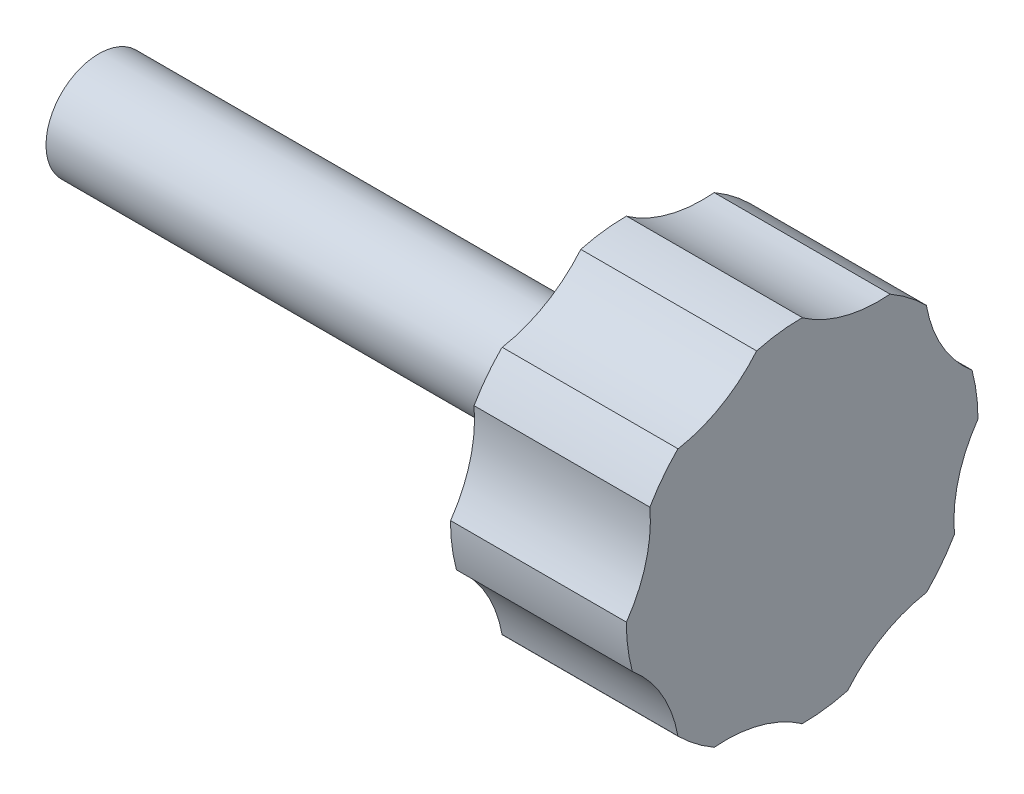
ISO-10303-21;
HEADER;
FILE_DESCRIPTION(('STEP AP214'),'2;1');
FILE_NAME('part.step','',(''),(''),'','','');
FILE_SCHEMA(('AUTOMOTIVE_DESIGN { 1 0 10303 214 1 1 1 1 }'));
ENDSEC;
DATA;
#1=APPLICATION_CONTEXT('core data for automotive mechanical design processes');
#2=APPLICATION_PROTOCOL_DEFINITION('international standard','automotive_design',2000,#1);
#3=PRODUCT_CONTEXT('',#1,'mechanical');
#4=PRODUCT('Part','Part','',(#3));
#5=PRODUCT_RELATED_PRODUCT_CATEGORY('part','',(#4));
#6=PRODUCT_DEFINITION_FORMATION('','',#4);
#7=PRODUCT_DEFINITION_CONTEXT('part definition',#1,'design');
#8=PRODUCT_DEFINITION('design','',#6,#7);
#9=PRODUCT_DEFINITION_SHAPE('','',#8);
#10=(LENGTH_UNIT() NAMED_UNIT(*) SI_UNIT(.MILLI.,.METRE.));
#11=(NAMED_UNIT(*) PLANE_ANGLE_UNIT() SI_UNIT($,.RADIAN.));
#12=(NAMED_UNIT(*) SI_UNIT($,.STERADIAN.) SOLID_ANGLE_UNIT());
#13=UNCERTAINTY_MEASURE_WITH_UNIT(LENGTH_MEASURE(1.E-05),#10,'distance_accuracy_value','');
#14=(GEOMETRIC_REPRESENTATION_CONTEXT(3) GLOBAL_UNCERTAINTY_ASSIGNED_CONTEXT((#13)) GLOBAL_UNIT_ASSIGNED_CONTEXT((#10,
#11,#12)) REPRESENTATION_CONTEXT('',''));
#15=CARTESIAN_POINT('',(0.,0.,0.));
#16=DIRECTION('',(0.,0.,1.));
#17=DIRECTION('',(1.,0.,0.));
#18=AXIS2_PLACEMENT_3D('',#15,#16,#17);
#19=CARTESIAN_POINT('',(0.,10.,0.));
#20=DIRECTION('',(-1.,0.,0.));
#21=DIRECTION('',(0.,0.,1.));
#22=AXIS2_PLACEMENT_3D('',#19,#20,#21);
#23=PLANE('',#22);
#24=CARTESIAN_POINT('',(0.,6.51014151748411,3.75411292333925));
#25=DIRECTION('',(1.,0.,0.));
#26=DIRECTION('',(0.,-0.707106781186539,0.707106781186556));
#27=AXIS2_PLACEMENT_3D('',#24,#25,#26);
#28=CIRCLE('',#27,3.35802196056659);
#29=CARTESIAN_POINT('',(0.,7.07842879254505,7.06369916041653));
#30=VERTEX_POINT('',#29);
#31=CARTESIAN_POINT('',(0.,7.06583669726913,7.06583669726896));
#32=VERTEX_POINT('',#31);
#33=EDGE_CURVE('E191',#30,#32,#28,.T.);
#34=ORIENTED_EDGE('',*,*,#33,.F.);
#35=CARTESIAN_POINT('',(0.,0.,0.));
#36=DIRECTION('',(-1.,0.,0.));
#37=DIRECTION('',(0.,0.,1.));
#38=AXIS2_PLACEMENT_3D('',#35,#36,#37);
#39=CIRCLE('',#38,10.);
#40=CARTESIAN_POINT('',(0.,5.0000000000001,8.66025403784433));
#41=VERTEX_POINT('',#40);
#42=EDGE_CURVE('E359',#41,#30,#39,.T.);
#43=ORIENTED_EDGE('',*,*,#42,.F.);
#44=CARTESIAN_POINT('',(0.,4.33132225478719,16.1989650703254));
#45=DIRECTION('',(1.,0.,0.));
#46=DIRECTION('',(0.,1.,0.));
#47=AXIS2_PLACEMENT_3D('',#44,#45,#46);
#48=CIRCLE('',#47,7.56830852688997);
#49=CARTESIAN_POINT('',(0.,1.03799650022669E-13,9.9926020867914));
#50=VERTEX_POINT('',#49);
#51=EDGE_CURVE('E52',#50,#41,#48,.T.);
#52=ORIENTED_EDGE('',*,*,#51,.F.);
#53=CARTESIAN_POINT('',(0.,1.94880650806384,7.25792391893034));
#54=DIRECTION('',(1.,0.,0.));
#55=DIRECTION('',(0.,-1.,0.));
#56=AXIS2_PLACEMENT_3D('',#53,#54,#55);
#57=CIRCLE('',#56,3.35802196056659);
#58=CARTESIAN_POINT('',(0.,0.0104154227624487,9.99999457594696));
#59=VERTEX_POINT('',#58);
#60=EDGE_CURVE('E215',#59,#50,#57,.T.);
#61=ORIENTED_EDGE('',*,*,#60,.F.);
#62=CARTESIAN_POINT('',(0.,-2.58819045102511,9.65925826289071));
#63=VERTEX_POINT('',#62);
#64=EDGE_CURVE('E355',#63,#59,#39,.T.);
#65=ORIENTED_EDGE('',*,*,#64,.F.);
#66=CARTESIAN_POINT('',(0.,-8.39169071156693,14.5171053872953));
#67=DIRECTION('',(1.,0.,0.));
#68=DIRECTION('',(0.,0.707106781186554,0.707106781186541));
#69=AXIS2_PLACEMENT_3D('',#66,#67,#68);
#70=CIRCLE('',#69,7.56830852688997);
#71=CARTESIAN_POINT('',(0.,-7.06583669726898,7.0658366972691));
#72=VERTEX_POINT('',#71);
#73=EDGE_CURVE('E231',#72,#63,#70,.T.);
#74=ORIENTED_EDGE('',*,*,#73,.F.);
#75=CARTESIAN_POINT('',(0.,-3.75411292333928,6.5101415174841));
#76=DIRECTION('',(1.,0.,0.));
#77=DIRECTION('',(0.,-0.707106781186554,-0.707106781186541));
#78=AXIS2_PLACEMENT_3D('',#75,#76,#77);
#79=CIRCLE('',#78,3.35802196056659);
#80=CARTESIAN_POINT('',(0.,-7.06369916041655,7.07842879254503));
#81=VERTEX_POINT('',#80);
#82=EDGE_CURVE('E229',#81,#72,#79,.T.);
#83=ORIENTED_EDGE('',*,*,#82,.F.);
#84=CARTESIAN_POINT('',(0.,-8.66025403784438,5.00000000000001));
#85=VERTEX_POINT('',#84);
#86=EDGE_CURVE('E358',#85,#81,#39,.T.);
#87=ORIENTED_EDGE('',*,*,#86,.F.);
#88=CARTESIAN_POINT('',(0.,-16.1989650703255,4.33132225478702));
#89=DIRECTION('',(1.,0.,0.));
#90=DIRECTION('',(0.,0.,1.));
#91=AXIS2_PLACEMENT_3D('',#88,#89,#90);
#92=CIRCLE('',#91,7.56830852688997);
#93=CARTESIAN_POINT('',(0.,-9.9926020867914,0.));
#94=VERTEX_POINT('',#93);
#95=EDGE_CURVE('E246',#94,#85,#92,.T.);
#96=ORIENTED_EDGE('',*,*,#95,.F.);
#97=CARTESIAN_POINT('',(0.,-7.25792391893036,1.94880650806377));
#98=DIRECTION('',(1.,0.,0.));
#99=DIRECTION('',(0.,0.,-1.));
#100=AXIS2_PLACEMENT_3D('',#97,#98,#99);
#101=CIRCLE('',#100,3.35802196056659);
#102=CARTESIAN_POINT('',(0.,-9.99999457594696,0.0104154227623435));
#103=VERTEX_POINT('',#102);
#104=EDGE_CURVE('E244',#103,#94,#101,.T.);
#105=ORIENTED_EDGE('',*,*,#104,.F.);
#106=CARTESIAN_POINT('',(0.,-9.6592582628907,-2.58819045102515));
#107=VERTEX_POINT('',#106);
#108=EDGE_CURVE('E361',#107,#103,#39,.T.);
#109=ORIENTED_EDGE('',*,*,#108,.F.);
#110=CARTESIAN_POINT('',(0.,-14.5171053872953,-8.39169071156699));
#111=DIRECTION('',(1.,0.,0.));
#112=DIRECTION('',(0.,-0.707106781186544,0.707106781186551));
#113=AXIS2_PLACEMENT_3D('',#110,#111,#112);
#114=CIRCLE('',#113,7.56830852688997);
#115=CARTESIAN_POINT('',(0.,-7.06583669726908,-7.06583669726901));
#116=VERTEX_POINT('',#115);
#117=EDGE_CURVE('E261',#116,#107,#114,.T.);
#118=ORIENTED_EDGE('',*,*,#117,.F.);
#119=CARTESIAN_POINT('',(0.,-6.51014151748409,-3.7541129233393));
#120=DIRECTION('',(1.,0.,0.));
#121=DIRECTION('',(0.,0.707106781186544,-0.707106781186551));
#122=AXIS2_PLACEMENT_3D('',#119,#120,#121);
#123=CIRCLE('',#122,3.35802196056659);
#124=CARTESIAN_POINT('',(0.,-7.07842879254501,-7.06369916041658));
#125=VERTEX_POINT('',#124);
#126=EDGE_CURVE('E259',#125,#116,#123,.T.);
#127=ORIENTED_EDGE('',*,*,#126,.F.);
#128=CARTESIAN_POINT('',(0.,-5.00000000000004,-8.66025403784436));
#129=VERTEX_POINT('',#128);
#130=EDGE_CURVE('E413',#129,#125,#39,.T.);
#131=ORIENTED_EDGE('',*,*,#130,.F.);
#132=CARTESIAN_POINT('',(0.,-4.33132225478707,-16.1989650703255));
#133=DIRECTION('',(1.,0.,0.));
#134=DIRECTION('',(0.,-1.,0.));
#135=AXIS2_PLACEMENT_3D('',#132,#133,#134);
#136=CIRCLE('',#135,7.56830852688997);
#137=CARTESIAN_POINT('',(0.,0.,-9.9926020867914));
#138=VERTEX_POINT('',#137);
#139=EDGE_CURVE('E276',#138,#129,#136,.T.);
#140=ORIENTED_EDGE('',*,*,#139,.F.);
#141=CARTESIAN_POINT('',(0.,-1.94880650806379,-7.25792391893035));
#142=DIRECTION('',(1.,0.,0.));
#143=DIRECTION('',(0.,1.,0.));
#144=AXIS2_PLACEMENT_3D('',#141,#142,#143);
#145=CIRCLE('',#144,3.35802196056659);
#146=CARTESIAN_POINT('',(0.,-0.0104154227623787,-9.99999457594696));
#147=VERTEX_POINT('',#146);
#148=EDGE_CURVE('E274',#147,#138,#145,.T.);
#149=ORIENTED_EDGE('',*,*,#148,.F.);
#150=CARTESIAN_POINT('',(0.,2.58819045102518,-9.65925826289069));
#151=VERTEX_POINT('',#150);
#152=EDGE_CURVE('E322',#151,#147,#39,.T.);
#153=ORIENTED_EDGE('',*,*,#152,.F.);
#154=CARTESIAN_POINT('',(0.,8.39169071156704,-14.5171053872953));
#155=DIRECTION('',(1.,0.,0.));
#156=DIRECTION('',(0.,-0.707106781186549,-0.707106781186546));
#157=AXIS2_PLACEMENT_3D('',#154,#155,#156);
#158=CIRCLE('',#157,7.56830852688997);
#159=CARTESIAN_POINT('',(0.,7.06583669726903,-7.06583669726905));
#160=VERTEX_POINT('',#159);
#161=EDGE_CURVE('E291',#160,#151,#158,.T.);
#162=ORIENTED_EDGE('',*,*,#161,.F.);
#163=CARTESIAN_POINT('',(0.,3.75411292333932,-6.51014151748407));
#164=DIRECTION('',(1.,0.,0.));
#165=DIRECTION('',(0.,0.707106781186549,0.707106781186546));
#166=AXIS2_PLACEMENT_3D('',#163,#164,#165);
#167=CIRCLE('',#166,3.35802196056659);
#168=CARTESIAN_POINT('',(0.,7.0636991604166,-7.07842879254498));
#169=VERTEX_POINT('',#168);
#170=EDGE_CURVE('E289',#169,#160,#167,.T.);
#171=ORIENTED_EDGE('',*,*,#170,.F.);
#172=CARTESIAN_POINT('',(0.,8.66025403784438,-5.00000000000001));
#173=VERTEX_POINT('',#172);
#174=EDGE_CURVE('E318',#173,#169,#39,.T.);
#175=ORIENTED_EDGE('',*,*,#174,.F.);
#176=CARTESIAN_POINT('',(0.,16.1989650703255,-4.33132225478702));
#177=DIRECTION('',(1.,0.,0.));
#178=DIRECTION('',(0.,0.,-1.));
#179=AXIS2_PLACEMENT_3D('',#176,#177,#178);
#180=CIRCLE('',#179,7.56830852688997);
#181=CARTESIAN_POINT('',(0.,9.9926020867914,0.));
#182=VERTEX_POINT('',#181);
#183=EDGE_CURVE('E306',#182,#173,#180,.T.);
#184=ORIENTED_EDGE('',*,*,#183,.F.);
#185=CARTESIAN_POINT('',(0.,7.25792391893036,-1.94880650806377));
#186=DIRECTION('',(1.,0.,0.));
#187=DIRECTION('',(0.,0.,1.));
#188=AXIS2_PLACEMENT_3D('',#185,#186,#187);
#189=CIRCLE('',#188,3.35802196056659);
#190=CARTESIAN_POINT('',(0.,9.99999457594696,-0.0104154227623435));
#191=VERTEX_POINT('',#190);
#192=EDGE_CURVE('E304',#191,#182,#189,.T.);
#193=ORIENTED_EDGE('',*,*,#192,.F.);
#194=CARTESIAN_POINT('',(0.,9.65925826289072,2.58819045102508));
#195=VERTEX_POINT('',#194);
#196=EDGE_CURVE('E208',#195,#191,#39,.T.);
#197=ORIENTED_EDGE('',*,*,#196,.F.);
#198=CARTESIAN_POINT('',(0.,14.5171053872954,8.39169071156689));
#199=DIRECTION('',(1.,0.,0.));
#200=DIRECTION('',(0.,0.707106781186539,-0.707106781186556));
#201=AXIS2_PLACEMENT_3D('',#198,#199,#200);
#202=CIRCLE('',#201,7.56830852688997);
#203=EDGE_CURVE('E44',#32,#195,#202,.T.);
#204=ORIENTED_EDGE('',*,*,#203,.F.);
#205=EDGE_LOOP('',(#34,#43,#52,#61,#65,#74,#83,#87,#96,#105,#109,#118,#127,#131,#140,#149,#153,
#162,#171,#175,#184,#193,#197,#204));
#206=FACE_BOUND('',#205,.T.);
#207=ADVANCED_FACE('F30',(#206),#23,.F.);
#208=CARTESIAN_POINT('',(-10.,3.,0.));
#209=DIRECTION('',(1.,0.,0.));
#210=DIRECTION('',(0.,0.,-1.));
#211=AXIS2_PLACEMENT_3D('',#208,#209,#210);
#212=PLANE('',#211);
#213=CARTESIAN_POINT('',(-10.,0.,0.));
#214=DIRECTION('',(-1.,0.,0.));
#215=DIRECTION('',(0.,0.,1.));
#216=AXIS2_PLACEMENT_3D('',#213,#214,#215);
#217=CIRCLE('',#216,3.);
#218=CARTESIAN_POINT('',(-10.,0.,3.));
#219=VERTEX_POINT('',#218);
#220=EDGE_CURVE('E326',#219,#219,#217,.T.);
#221=ORIENTED_EDGE('',*,*,#220,.F.);
#222=EDGE_LOOP('',(#221));
#223=FACE_BOUND('',#222,.T.);
#224=CARTESIAN_POINT('',(-10.,6.51014151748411,3.75411292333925));
#225=DIRECTION('',(1.,0.,0.));
#226=DIRECTION('',(0.,-0.707106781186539,0.707106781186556));
#227=AXIS2_PLACEMENT_3D('',#224,#225,#226);
#228=CIRCLE('',#227,3.35802196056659);
#229=CARTESIAN_POINT('',(-10.,7.07842879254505,7.06369916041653));
#230=VERTEX_POINT('',#229);
#231=CARTESIAN_POINT('',(-10.,7.06583669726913,7.06583669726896));
#232=VERTEX_POINT('',#231);
#233=EDGE_CURVE('E212',#230,#232,#228,.T.);
#234=ORIENTED_EDGE('',*,*,#233,.T.);
#235=CARTESIAN_POINT('',(-10.,14.5171053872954,8.39169071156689));
#236=DIRECTION('',(1.,0.,0.));
#237=DIRECTION('',(0.,0.707106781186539,-0.707106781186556));
#238=AXIS2_PLACEMENT_3D('',#235,#236,#237);
#239=CIRCLE('',#238,7.56830852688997);
#240=CARTESIAN_POINT('',(-10.,9.65925826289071,2.58819045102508));
#241=VERTEX_POINT('',#240);
#242=EDGE_CURVE('E199',#232,#241,#239,.T.);
#243=ORIENTED_EDGE('',*,*,#242,.T.);
#244=CARTESIAN_POINT('',(-10.,0.,0.));
#245=DIRECTION('',(-1.,0.,0.));
#246=DIRECTION('',(0.,0.,1.));
#247=AXIS2_PLACEMENT_3D('',#244,#245,#246);
#248=CIRCLE('',#247,10.);
#249=CARTESIAN_POINT('',(-10.,9.99999457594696,-0.0104154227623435));
#250=VERTEX_POINT('',#249);
#251=EDGE_CURVE('E321',#241,#250,#248,.T.);
#252=ORIENTED_EDGE('',*,*,#251,.T.);
#253=CARTESIAN_POINT('',(-10.,7.25792391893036,-1.94880650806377));
#254=DIRECTION('',(1.,0.,0.));
#255=DIRECTION('',(0.,0.,1.));
#256=AXIS2_PLACEMENT_3D('',#253,#254,#255);
#257=CIRCLE('',#256,3.35802196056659);
#258=CARTESIAN_POINT('',(-10.,9.9926020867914,0.));
#259=VERTEX_POINT('',#258);
#260=EDGE_CURVE('E303',#250,#259,#257,.T.);
#261=ORIENTED_EDGE('',*,*,#260,.T.);
#262=CARTESIAN_POINT('',(-10.,16.1989650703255,-4.33132225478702));
#263=DIRECTION('',(1.,0.,0.));
#264=DIRECTION('',(0.,0.,-1.));
#265=AXIS2_PLACEMENT_3D('',#262,#263,#264);
#266=CIRCLE('',#265,7.56830852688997);
#267=CARTESIAN_POINT('',(-10.,8.66025403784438,-5.00000000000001));
#268=VERTEX_POINT('',#267);
#269=EDGE_CURVE('E307',#259,#268,#266,.T.);
#270=ORIENTED_EDGE('',*,*,#269,.T.);
#271=CARTESIAN_POINT('',(-10.,7.0636991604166,-7.07842879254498));
#272=VERTEX_POINT('',#271);
#273=EDGE_CURVE('E323',#268,#272,#248,.T.);
#274=ORIENTED_EDGE('',*,*,#273,.T.);
#275=CARTESIAN_POINT('',(-10.,3.75411292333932,-6.51014151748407));
#276=DIRECTION('',(1.,0.,0.));
#277=DIRECTION('',(0.,0.707106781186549,0.707106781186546));
#278=AXIS2_PLACEMENT_3D('',#275,#276,#277);
#279=CIRCLE('',#278,3.35802196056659);
#280=CARTESIAN_POINT('',(-10.,7.06583669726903,-7.06583669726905));
#281=VERTEX_POINT('',#280);
#282=EDGE_CURVE('E288',#272,#281,#279,.T.);
#283=ORIENTED_EDGE('',*,*,#282,.T.);
#284=CARTESIAN_POINT('',(-10.,8.39169071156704,-14.5171053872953));
#285=DIRECTION('',(1.,0.,0.));
#286=DIRECTION('',(0.,-0.707106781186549,-0.707106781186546));
#287=AXIS2_PLACEMENT_3D('',#284,#285,#286);
#288=CIRCLE('',#287,7.56830852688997);
#289=CARTESIAN_POINT('',(-10.,2.58819045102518,-9.65925826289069));
#290=VERTEX_POINT('',#289);
#291=EDGE_CURVE('E292',#281,#290,#288,.T.);
#292=ORIENTED_EDGE('',*,*,#291,.T.);
#293=CARTESIAN_POINT('',(-10.,-0.0104154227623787,-9.99999457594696));
#294=VERTEX_POINT('',#293);
#295=EDGE_CURVE('E327',#290,#294,#248,.T.);
#296=ORIENTED_EDGE('',*,*,#295,.T.);
#297=CARTESIAN_POINT('',(-10.,-1.94880650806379,-7.25792391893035));
#298=DIRECTION('',(1.,0.,0.));
#299=DIRECTION('',(0.,1.,0.));
#300=AXIS2_PLACEMENT_3D('',#297,#298,#299);
#301=CIRCLE('',#300,3.35802196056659);
#302=CARTESIAN_POINT('',(-10.,0.,-9.9926020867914));
#303=VERTEX_POINT('',#302);
#304=EDGE_CURVE('E273',#294,#303,#301,.T.);
#305=ORIENTED_EDGE('',*,*,#304,.T.);
#306=CARTESIAN_POINT('',(-10.,-4.33132225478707,-16.1989650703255));
#307=DIRECTION('',(1.,0.,0.));
#308=DIRECTION('',(0.,-1.,0.));
#309=AXIS2_PLACEMENT_3D('',#306,#307,#308);
#310=CIRCLE('',#309,7.56830852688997);
#311=CARTESIAN_POINT('',(-10.,-5.00000000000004,-8.66025403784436));
#312=VERTEX_POINT('',#311);
#313=EDGE_CURVE('E277',#303,#312,#310,.T.);
#314=ORIENTED_EDGE('',*,*,#313,.T.);
#315=CARTESIAN_POINT('',(-10.,-7.07842879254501,-7.06369916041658));
#316=VERTEX_POINT('',#315);
#317=EDGE_CURVE('E392',#312,#316,#248,.T.);
#318=ORIENTED_EDGE('',*,*,#317,.T.);
#319=CARTESIAN_POINT('',(-10.,-6.51014151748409,-3.7541129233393));
#320=DIRECTION('',(1.,0.,0.));
#321=DIRECTION('',(0.,0.707106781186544,-0.707106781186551));
#322=AXIS2_PLACEMENT_3D('',#319,#320,#321);
#323=CIRCLE('',#322,3.35802196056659);
#324=CARTESIAN_POINT('',(-10.,-7.06583669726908,-7.06583669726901));
#325=VERTEX_POINT('',#324);
#326=EDGE_CURVE('E258',#316,#325,#323,.T.);
#327=ORIENTED_EDGE('',*,*,#326,.T.);
#328=CARTESIAN_POINT('',(-10.,-14.5171053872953,-8.39169071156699));
#329=DIRECTION('',(1.,0.,0.));
#330=DIRECTION('',(0.,-0.707106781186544,0.707106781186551));
#331=AXIS2_PLACEMENT_3D('',#328,#329,#330);
#332=CIRCLE('',#331,7.56830852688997);
#333=CARTESIAN_POINT('',(-10.,-9.6592582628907,-2.58819045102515));
#334=VERTEX_POINT('',#333);
#335=EDGE_CURVE('E262',#325,#334,#332,.T.);
#336=ORIENTED_EDGE('',*,*,#335,.T.);
#337=CARTESIAN_POINT('',(-10.,-9.99999457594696,0.0104154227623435));
#338=VERTEX_POINT('',#337);
#339=EDGE_CURVE('E389',#334,#338,#248,.T.);
#340=ORIENTED_EDGE('',*,*,#339,.T.);
#341=CARTESIAN_POINT('',(-10.,-7.25792391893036,1.94880650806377));
#342=DIRECTION('',(1.,0.,0.));
#343=DIRECTION('',(0.,0.,-1.));
#344=AXIS2_PLACEMENT_3D('',#341,#342,#343);
#345=CIRCLE('',#344,3.35802196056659);
#346=CARTESIAN_POINT('',(-10.,-9.9926020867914,0.));
#347=VERTEX_POINT('',#346);
#348=EDGE_CURVE('E243',#338,#347,#345,.T.);
#349=ORIENTED_EDGE('',*,*,#348,.T.);
#350=CARTESIAN_POINT('',(-10.,-16.1989650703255,4.33132225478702));
#351=DIRECTION('',(1.,0.,0.));
#352=DIRECTION('',(0.,0.,1.));
#353=AXIS2_PLACEMENT_3D('',#350,#351,#352);
#354=CIRCLE('',#353,7.56830852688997);
#355=CARTESIAN_POINT('',(-10.,-8.66025403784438,5.00000000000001));
#356=VERTEX_POINT('',#355);
#357=EDGE_CURVE('E247',#347,#356,#354,.T.);
#358=ORIENTED_EDGE('',*,*,#357,.T.);
#359=CARTESIAN_POINT('',(-10.,-7.06369916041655,7.07842879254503));
#360=VERTEX_POINT('',#359);
#361=EDGE_CURVE('E387',#356,#360,#248,.T.);
#362=ORIENTED_EDGE('',*,*,#361,.T.);
#363=CARTESIAN_POINT('',(-10.,-3.75411292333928,6.5101415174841));
#364=DIRECTION('',(1.,0.,0.));
#365=DIRECTION('',(0.,-0.707106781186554,-0.707106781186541));
#366=AXIS2_PLACEMENT_3D('',#363,#364,#365);
#367=CIRCLE('',#366,3.35802196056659);
#368=CARTESIAN_POINT('',(-10.,-7.06583669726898,7.0658366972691));
#369=VERTEX_POINT('',#368);
#370=EDGE_CURVE('E228',#360,#369,#367,.T.);
#371=ORIENTED_EDGE('',*,*,#370,.T.);
#372=CARTESIAN_POINT('',(-10.,-8.39169071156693,14.5171053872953));
#373=DIRECTION('',(1.,0.,0.));
#374=DIRECTION('',(0.,0.707106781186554,0.707106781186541));
#375=AXIS2_PLACEMENT_3D('',#372,#373,#374);
#376=CIRCLE('',#375,7.56830852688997);
#377=CARTESIAN_POINT('',(-10.,-2.58819045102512,9.65925826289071));
#378=VERTEX_POINT('',#377);
#379=EDGE_CURVE('E232',#369,#378,#376,.T.);
#380=ORIENTED_EDGE('',*,*,#379,.T.);
#381=CARTESIAN_POINT('',(-10.,0.0104154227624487,9.99999457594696));
#382=VERTEX_POINT('',#381);
#383=EDGE_CURVE('E385',#378,#382,#248,.T.);
#384=ORIENTED_EDGE('',*,*,#383,.T.);
#385=CARTESIAN_POINT('',(-10.,1.94880650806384,7.25792391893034));
#386=DIRECTION('',(1.,0.,0.));
#387=DIRECTION('',(0.,-1.,0.));
#388=AXIS2_PLACEMENT_3D('',#385,#386,#387);
#389=CIRCLE('',#388,3.35802196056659);
#390=CARTESIAN_POINT('',(-10.,1.03799650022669E-13,9.9926020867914));
#391=VERTEX_POINT('',#390);
#392=EDGE_CURVE('E203',#382,#391,#389,.T.);
#393=ORIENTED_EDGE('',*,*,#392,.T.);
#394=CARTESIAN_POINT('',(-10.,4.33132225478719,16.1989650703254));
#395=DIRECTION('',(1.,0.,0.));
#396=DIRECTION('',(0.,1.,0.));
#397=AXIS2_PLACEMENT_3D('',#394,#395,#396);
#398=CIRCLE('',#397,7.56830852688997);
#399=CARTESIAN_POINT('',(-10.,5.0000000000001,8.66025403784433));
#400=VERTEX_POINT('',#399);
#401=EDGE_CURVE('E217',#391,#400,#398,.T.);
#402=ORIENTED_EDGE('',*,*,#401,.T.);
#403=EDGE_CURVE('E383',#400,#230,#248,.T.);
#404=ORIENTED_EDGE('',*,*,#403,.T.);
#405=EDGE_LOOP('',(#234,#243,#252,#261,#270,#274,#283,#292,#296,#305,#314,#318,#327,#336,#340,
#349,#358,#362,#371,#380,#384,#393,#402,#404));
#406=FACE_BOUND('',#405,.T.);
#407=ADVANCED_FACE('F382',(#223,#406),#212,.F.);
#408=CARTESIAN_POINT('',(0.,0.,0.));
#409=DIRECTION('',(-1.,0.,0.));
#410=DIRECTION('',(0.,0.,1.));
#411=AXIS2_PLACEMENT_3D('',#408,#409,#410);
#412=CYLINDRICAL_SURFACE('',#411,10.);
#413=DIRECTION('',(-1.,0.,0.));
#414=VECTOR('',#413,1.);
#415=CARTESIAN_POINT('',(-5.,7.07842879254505,7.06369916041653));
#416=LINE('',#415,#414);
#417=EDGE_CURVE('E11',#230,#30,#416,.F.);
#418=ORIENTED_EDGE('',*,*,#417,.F.);
#419=ORIENTED_EDGE('',*,*,#403,.F.);
#420=DIRECTION('',(-1.,0.,0.));
#421=VECTOR('',#420,1.);
#422=CARTESIAN_POINT('',(0.,5.0000000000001,8.66025403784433));
#423=LINE('',#422,#421);
#424=EDGE_CURVE('E219',#41,#400,#423,.T.);
#425=ORIENTED_EDGE('',*,*,#424,.F.);
#426=ORIENTED_EDGE('',*,*,#42,.T.);
#427=EDGE_LOOP('',(#418,#419,#425,#426));
#428=FACE_BOUND('',#427,.T.);
#429=ADVANCED_FACE('F463',(#428),#412,.T.);
#430=DIRECTION('',(-1.,0.,0.));
#431=VECTOR('',#430,1.);
#432=CARTESIAN_POINT('',(0.,9.65925826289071,2.58819045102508));
#433=LINE('',#432,#431);
#434=EDGE_CURVE('E204',#195,#241,#433,.T.);
#435=ORIENTED_EDGE('',*,*,#434,.F.);
#436=ORIENTED_EDGE('',*,*,#196,.T.);
#437=DIRECTION('',(-1.,0.,0.));
#438=VECTOR('',#437,1.);
#439=CARTESIAN_POINT('',(-5.,9.99999457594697,-0.0104154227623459));
#440=LINE('',#439,#438);
#441=EDGE_CURVE('E333',#250,#191,#440,.F.);
#442=ORIENTED_EDGE('',*,*,#441,.F.);
#443=ORIENTED_EDGE('',*,*,#251,.F.);
#444=EDGE_LOOP('',(#435,#436,#442,#443));
#445=FACE_BOUND('',#444,.T.);
#446=ADVANCED_FACE('F365',(#445),#412,.T.);
#447=DIRECTION('',(-1.,0.,0.));
#448=VECTOR('',#447,1.);
#449=CARTESIAN_POINT('',(-5.,0.0104154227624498,9.99999457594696));
#450=LINE('',#449,#448);
#451=EDGE_CURVE('E37',#382,#59,#450,.F.);
#452=ORIENTED_EDGE('',*,*,#451,.F.);
#453=ORIENTED_EDGE('',*,*,#383,.F.);
#454=DIRECTION('',(-1.,0.,0.));
#455=VECTOR('',#454,1.);
#456=CARTESIAN_POINT('',(0.,-2.58819045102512,9.65925826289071));
#457=LINE('',#456,#455);
#458=EDGE_CURVE('E234',#63,#378,#457,.T.);
#459=ORIENTED_EDGE('',*,*,#458,.F.);
#460=ORIENTED_EDGE('',*,*,#64,.T.);
#461=EDGE_LOOP('',(#452,#453,#459,#460));
#462=FACE_BOUND('',#461,.T.);
#463=ADVANCED_FACE('F357',(#462),#412,.T.);
#464=DIRECTION('',(-1.,0.,0.));
#465=VECTOR('',#464,1.);
#466=CARTESIAN_POINT('',(-5.,-7.06369916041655,7.07842879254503));
#467=LINE('',#466,#465);
#468=EDGE_CURVE('E344',#360,#81,#467,.F.);
#469=ORIENTED_EDGE('',*,*,#468,.F.);
#470=ORIENTED_EDGE('',*,*,#361,.F.);
#471=DIRECTION('',(-1.,0.,0.));
#472=VECTOR('',#471,1.);
#473=CARTESIAN_POINT('',(0.,-8.66025403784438,5.00000000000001));
#474=LINE('',#473,#472);
#475=EDGE_CURVE('E249',#85,#356,#474,.T.);
#476=ORIENTED_EDGE('',*,*,#475,.F.);
#477=ORIENTED_EDGE('',*,*,#86,.T.);
#478=EDGE_LOOP('',(#469,#470,#476,#477));
#479=FACE_BOUND('',#478,.T.);
#480=ADVANCED_FACE('F444',(#479),#412,.T.);
#481=DIRECTION('',(-1.,0.,0.));
#482=VECTOR('',#481,1.);
#483=CARTESIAN_POINT('',(-5.,-9.99999457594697,0.0104154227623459));
#484=LINE('',#483,#482);
#485=EDGE_CURVE('E342',#338,#103,#484,.F.);
#486=ORIENTED_EDGE('',*,*,#485,.F.);
#487=ORIENTED_EDGE('',*,*,#339,.F.);
#488=DIRECTION('',(-1.,0.,0.));
#489=VECTOR('',#488,1.);
#490=CARTESIAN_POINT('',(0.,-9.6592582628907,-2.58819045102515));
#491=LINE('',#490,#489);
#492=EDGE_CURVE('E264',#107,#334,#491,.T.);
#493=ORIENTED_EDGE('',*,*,#492,.F.);
#494=ORIENTED_EDGE('',*,*,#108,.T.);
#495=EDGE_LOOP('',(#486,#487,#493,#494));
#496=FACE_BOUND('',#495,.T.);
#497=ADVANCED_FACE('F432',(#496),#412,.T.);
#498=DIRECTION('',(-1.,0.,0.));
#499=VECTOR('',#498,1.);
#500=CARTESIAN_POINT('',(-5.,-7.078428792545,-7.06369916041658));
#501=LINE('',#500,#499);
#502=EDGE_CURVE('E340',#316,#125,#501,.F.);
#503=ORIENTED_EDGE('',*,*,#502,.F.);
#504=ORIENTED_EDGE('',*,*,#317,.F.);
#505=DIRECTION('',(-1.,0.,0.));
#506=VECTOR('',#505,1.);
#507=CARTESIAN_POINT('',(0.,-5.00000000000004,-8.66025403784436));
#508=LINE('',#507,#506);
#509=EDGE_CURVE('E279',#129,#312,#508,.T.);
#510=ORIENTED_EDGE('',*,*,#509,.F.);
#511=ORIENTED_EDGE('',*,*,#130,.T.);
#512=EDGE_LOOP('',(#503,#504,#510,#511));
#513=FACE_BOUND('',#512,.T.);
#514=ADVANCED_FACE('F419',(#513),#412,.T.);
#515=DIRECTION('',(-1.,0.,0.));
#516=VECTOR('',#515,1.);
#517=CARTESIAN_POINT('',(-5.,-0.0104154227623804,-9.99999457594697));
#518=LINE('',#517,#516);
#519=EDGE_CURVE('E338',#294,#147,#518,.F.);
#520=ORIENTED_EDGE('',*,*,#519,.F.);
#521=ORIENTED_EDGE('',*,*,#295,.F.);
#522=DIRECTION('',(-1.,0.,0.));
#523=VECTOR('',#522,1.);
#524=CARTESIAN_POINT('',(0.,2.58819045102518,-9.65925826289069));
#525=LINE('',#524,#523);
#526=EDGE_CURVE('E294',#151,#290,#525,.T.);
#527=ORIENTED_EDGE('',*,*,#526,.F.);
#528=ORIENTED_EDGE('',*,*,#152,.T.);
#529=EDGE_LOOP('',(#520,#521,#527,#528));
#530=FACE_BOUND('',#529,.T.);
#531=ADVANCED_FACE('F401',(#530),#412,.T.);
#532=DIRECTION('',(-1.,0.,0.));
#533=VECTOR('',#532,1.);
#534=CARTESIAN_POINT('',(-5.,7.0636991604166,-7.07842879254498));
#535=LINE('',#534,#533);
#536=EDGE_CURVE('E336',#272,#169,#535,.F.);
#537=ORIENTED_EDGE('',*,*,#536,.F.);
#538=ORIENTED_EDGE('',*,*,#273,.F.);
#539=DIRECTION('',(-1.,0.,0.));
#540=VECTOR('',#539,1.);
#541=CARTESIAN_POINT('',(0.,8.66025403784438,-5.00000000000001));
#542=LINE('',#541,#540);
#543=EDGE_CURVE('E309',#173,#268,#542,.T.);
#544=ORIENTED_EDGE('',*,*,#543,.F.);
#545=ORIENTED_EDGE('',*,*,#174,.T.);
#546=EDGE_LOOP('',(#537,#538,#544,#545));
#547=FACE_BOUND('',#546,.T.);
#548=ADVANCED_FACE('F380',(#547),#412,.T.);
#549=CARTESIAN_POINT('',(-40.,0.,0.));
#550=DIRECTION('',(1.,0.,0.));
#551=DIRECTION('',(0.,0.,-1.));
#552=AXIS2_PLACEMENT_3D('',#549,#550,#551);
#553=PLANE('',#552);
#554=CARTESIAN_POINT('',(-40.,0.,0.));
#555=DIRECTION('',(-1.,0.,0.));
#556=DIRECTION('',(0.,0.,1.));
#557=AXIS2_PLACEMENT_3D('',#554,#555,#556);
#558=CIRCLE('',#557,3.);
#559=CARTESIAN_POINT('',(-40.,0.,3.));
#560=VERTEX_POINT('',#559);
#561=EDGE_CURVE('E330',#560,#560,#558,.T.);
#562=ORIENTED_EDGE('',*,*,#561,.T.);
#563=EDGE_LOOP('',(#562));
#564=FACE_BOUND('',#563,.T.);
#565=ADVANCED_FACE('F475',(#564),#553,.F.);
#566=CARTESIAN_POINT('',(0.,0.,0.));
#567=DIRECTION('',(-1.,0.,0.));
#568=DIRECTION('',(0.,0.,1.));
#569=AXIS2_PLACEMENT_3D('',#566,#567,#568);
#570=CYLINDRICAL_SURFACE('',#569,3.);
#571=ORIENTED_EDGE('',*,*,#561,.F.);
#572=EDGE_LOOP('',(#571));
#573=FACE_BOUND('',#572,.T.);
#574=ORIENTED_EDGE('',*,*,#220,.T.);
#575=EDGE_LOOP('',(#574));
#576=FACE_BOUND('',#575,.T.);
#577=ADVANCED_FACE('F473',(#573,#576),#570,.T.);
#578=CARTESIAN_POINT('',(0.,7.25792391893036,-1.94880650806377));
#579=DIRECTION('',(-1.,0.,0.));
#580=DIRECTION('',(0.,0.,1.));
#581=AXIS2_PLACEMENT_3D('',#578,#579,#580);
#582=CYLINDRICAL_SURFACE('',#581,3.35802196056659);
#583=ORIENTED_EDGE('',*,*,#441,.T.);
#584=ORIENTED_EDGE('',*,*,#192,.T.);
#585=DIRECTION('',(-1.,0.,0.));
#586=VECTOR('',#585,1.);
#587=CARTESIAN_POINT('',(0.,9.9926020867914,0.));
#588=LINE('',#587,#586);
#589=EDGE_CURVE('E315',#182,#259,#588,.T.);
#590=ORIENTED_EDGE('',*,*,#589,.T.);
#591=ORIENTED_EDGE('',*,*,#260,.F.);
#592=EDGE_LOOP('',(#583,#584,#590,#591));
#593=FACE_BOUND('',#592,.T.);
#594=ADVANCED_FACE('F369',(#593),#582,.F.);
#595=CARTESIAN_POINT('',(0.,16.1989650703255,-4.33132225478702));
#596=DIRECTION('',(-1.,0.,0.));
#597=DIRECTION('',(0.,0.,1.));
#598=AXIS2_PLACEMENT_3D('',#595,#596,#597);
#599=CYLINDRICAL_SURFACE('',#598,7.56830852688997);
#600=ORIENTED_EDGE('',*,*,#269,.F.);
#601=ORIENTED_EDGE('',*,*,#589,.F.);
#602=ORIENTED_EDGE('',*,*,#183,.T.);
#603=ORIENTED_EDGE('',*,*,#543,.T.);
#604=EDGE_LOOP('',(#600,#601,#602,#603));
#605=FACE_BOUND('',#604,.T.);
#606=ADVANCED_FACE('F376',(#605),#599,.F.);
#607=CARTESIAN_POINT('',(0.,3.75411292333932,-6.51014151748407));
#608=DIRECTION('',(-1.,0.,0.));
#609=DIRECTION('',(0.,0.,1.));
#610=AXIS2_PLACEMENT_3D('',#607,#608,#609);
#611=CYLINDRICAL_SURFACE('',#610,3.35802196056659);
#612=ORIENTED_EDGE('',*,*,#536,.T.);
#613=ORIENTED_EDGE('',*,*,#170,.T.);
#614=DIRECTION('',(-1.,0.,0.));
#615=VECTOR('',#614,1.);
#616=CARTESIAN_POINT('',(0.,7.06583669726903,-7.06583669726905));
#617=LINE('',#616,#615);
#618=EDGE_CURVE('E300',#160,#281,#617,.T.);
#619=ORIENTED_EDGE('',*,*,#618,.T.);
#620=ORIENTED_EDGE('',*,*,#282,.F.);
#621=EDGE_LOOP('',(#612,#613,#619,#620));
#622=FACE_BOUND('',#621,.T.);
#623=ADVANCED_FACE('F526',(#622),#611,.F.);
#624=CARTESIAN_POINT('',(0.,8.39169071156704,-14.5171053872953));
#625=DIRECTION('',(-1.,0.,0.));
#626=DIRECTION('',(0.,0.,1.));
#627=AXIS2_PLACEMENT_3D('',#624,#625,#626);
#628=CYLINDRICAL_SURFACE('',#627,7.56830852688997);
#629=ORIENTED_EDGE('',*,*,#291,.F.);
#630=ORIENTED_EDGE('',*,*,#618,.F.);
#631=ORIENTED_EDGE('',*,*,#161,.T.);
#632=ORIENTED_EDGE('',*,*,#526,.T.);
#633=EDGE_LOOP('',(#629,#630,#631,#632));
#634=FACE_BOUND('',#633,.T.);
#635=ADVANCED_FACE('F551',(#634),#628,.F.);
#636=CARTESIAN_POINT('',(0.,-1.94880650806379,-7.25792391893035));
#637=DIRECTION('',(-1.,0.,0.));
#638=DIRECTION('',(0.,0.,1.));
#639=AXIS2_PLACEMENT_3D('',#636,#637,#638);
#640=CYLINDRICAL_SURFACE('',#639,3.35802196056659);
#641=ORIENTED_EDGE('',*,*,#519,.T.);
#642=ORIENTED_EDGE('',*,*,#148,.T.);
#643=DIRECTION('',(-1.,0.,0.));
#644=VECTOR('',#643,1.);
#645=CARTESIAN_POINT('',(0.,0.,-9.9926020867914));
#646=LINE('',#645,#644);
#647=EDGE_CURVE('E285',#138,#303,#646,.T.);
#648=ORIENTED_EDGE('',*,*,#647,.T.);
#649=ORIENTED_EDGE('',*,*,#304,.F.);
#650=EDGE_LOOP('',(#641,#642,#648,#649));
#651=FACE_BOUND('',#650,.T.);
#652=ADVANCED_FACE('F406',(#651),#640,.F.);
#653=CARTESIAN_POINT('',(0.,-4.33132225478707,-16.1989650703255));
#654=DIRECTION('',(-1.,0.,0.));
#655=DIRECTION('',(0.,0.,1.));
#656=AXIS2_PLACEMENT_3D('',#653,#654,#655);
#657=CYLINDRICAL_SURFACE('',#656,7.56830852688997);
#658=ORIENTED_EDGE('',*,*,#313,.F.);
#659=ORIENTED_EDGE('',*,*,#647,.F.);
#660=ORIENTED_EDGE('',*,*,#139,.T.);
#661=ORIENTED_EDGE('',*,*,#509,.T.);
#662=EDGE_LOOP('',(#658,#659,#660,#661));
#663=FACE_BOUND('',#662,.T.);
#664=ADVANCED_FACE('F416',(#663),#657,.F.);
#665=CARTESIAN_POINT('',(0.,-6.51014151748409,-3.7541129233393));
#666=DIRECTION('',(-1.,0.,0.));
#667=DIRECTION('',(0.,0.,1.));
#668=AXIS2_PLACEMENT_3D('',#665,#666,#667);
#669=CYLINDRICAL_SURFACE('',#668,3.35802196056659);
#670=ORIENTED_EDGE('',*,*,#502,.T.);
#671=ORIENTED_EDGE('',*,*,#126,.T.);
#672=DIRECTION('',(-1.,0.,0.));
#673=VECTOR('',#672,1.);
#674=CARTESIAN_POINT('',(0.,-7.06583669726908,-7.06583669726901));
#675=LINE('',#674,#673);
#676=EDGE_CURVE('E270',#116,#325,#675,.T.);
#677=ORIENTED_EDGE('',*,*,#676,.T.);
#678=ORIENTED_EDGE('',*,*,#326,.F.);
#679=EDGE_LOOP('',(#670,#671,#677,#678));
#680=FACE_BOUND('',#679,.T.);
#681=ADVANCED_FACE('F421',(#680),#669,.F.);
#682=CARTESIAN_POINT('',(0.,-14.5171053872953,-8.39169071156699));
#683=DIRECTION('',(-1.,0.,0.));
#684=DIRECTION('',(0.,0.,1.));
#685=AXIS2_PLACEMENT_3D('',#682,#683,#684);
#686=CYLINDRICAL_SURFACE('',#685,7.56830852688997);
#687=ORIENTED_EDGE('',*,*,#335,.F.);
#688=ORIENTED_EDGE('',*,*,#676,.F.);
#689=ORIENTED_EDGE('',*,*,#117,.T.);
#690=ORIENTED_EDGE('',*,*,#492,.T.);
#691=EDGE_LOOP('',(#687,#688,#689,#690));
#692=FACE_BOUND('',#691,.T.);
#693=ADVANCED_FACE('F429',(#692),#686,.F.);
#694=CARTESIAN_POINT('',(0.,-7.25792391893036,1.94880650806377));
#695=DIRECTION('',(-1.,0.,0.));
#696=DIRECTION('',(0.,0.,1.));
#697=AXIS2_PLACEMENT_3D('',#694,#695,#696);
#698=CYLINDRICAL_SURFACE('',#697,3.35802196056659);
#699=ORIENTED_EDGE('',*,*,#485,.T.);
#700=ORIENTED_EDGE('',*,*,#104,.T.);
#701=DIRECTION('',(-1.,0.,0.));
#702=VECTOR('',#701,1.);
#703=CARTESIAN_POINT('',(0.,-9.9926020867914,0.));
#704=LINE('',#703,#702);
#705=EDGE_CURVE('E255',#94,#347,#704,.T.);
#706=ORIENTED_EDGE('',*,*,#705,.T.);
#707=ORIENTED_EDGE('',*,*,#348,.F.);
#708=EDGE_LOOP('',(#699,#700,#706,#707));
#709=FACE_BOUND('',#708,.T.);
#710=ADVANCED_FACE('F434',(#709),#698,.F.);
#711=CARTESIAN_POINT('',(0.,-16.1989650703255,4.33132225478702));
#712=DIRECTION('',(-1.,0.,0.));
#713=DIRECTION('',(0.,0.,1.));
#714=AXIS2_PLACEMENT_3D('',#711,#712,#713);
#715=CYLINDRICAL_SURFACE('',#714,7.56830852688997);
#716=ORIENTED_EDGE('',*,*,#357,.F.);
#717=ORIENTED_EDGE('',*,*,#705,.F.);
#718=ORIENTED_EDGE('',*,*,#95,.T.);
#719=ORIENTED_EDGE('',*,*,#475,.T.);
#720=EDGE_LOOP('',(#716,#717,#718,#719));
#721=FACE_BOUND('',#720,.T.);
#722=ADVANCED_FACE('F441',(#721),#715,.F.);
#723=CARTESIAN_POINT('',(0.,-3.75411292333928,6.5101415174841));
#724=DIRECTION('',(-1.,0.,0.));
#725=DIRECTION('',(0.,0.,1.));
#726=AXIS2_PLACEMENT_3D('',#723,#724,#725);
#727=CYLINDRICAL_SURFACE('',#726,3.35802196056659);
#728=ORIENTED_EDGE('',*,*,#468,.T.);
#729=ORIENTED_EDGE('',*,*,#82,.T.);
#730=DIRECTION('',(-1.,0.,0.));
#731=VECTOR('',#730,1.);
#732=CARTESIAN_POINT('',(0.,-7.06583669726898,7.0658366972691));
#733=LINE('',#732,#731);
#734=EDGE_CURVE('E240',#72,#369,#733,.T.);
#735=ORIENTED_EDGE('',*,*,#734,.T.);
#736=ORIENTED_EDGE('',*,*,#370,.F.);
#737=EDGE_LOOP('',(#728,#729,#735,#736));
#738=FACE_BOUND('',#737,.T.);
#739=ADVANCED_FACE('F446',(#738),#727,.F.);
#740=CARTESIAN_POINT('',(0.,-8.39169071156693,14.5171053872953));
#741=DIRECTION('',(-1.,0.,0.));
#742=DIRECTION('',(0.,0.,1.));
#743=AXIS2_PLACEMENT_3D('',#740,#741,#742);
#744=CYLINDRICAL_SURFACE('',#743,7.56830852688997);
#745=ORIENTED_EDGE('',*,*,#379,.F.);
#746=ORIENTED_EDGE('',*,*,#734,.F.);
#747=ORIENTED_EDGE('',*,*,#73,.T.);
#748=ORIENTED_EDGE('',*,*,#458,.T.);
#749=EDGE_LOOP('',(#745,#746,#747,#748));
#750=FACE_BOUND('',#749,.T.);
#751=ADVANCED_FACE('F449',(#750),#744,.F.);
#752=CARTESIAN_POINT('',(0.,1.94880650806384,7.25792391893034));
#753=DIRECTION('',(-1.,0.,0.));
#754=DIRECTION('',(0.,0.,1.));
#755=AXIS2_PLACEMENT_3D('',#752,#753,#754);
#756=CYLINDRICAL_SURFACE('',#755,3.35802196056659);
#757=ORIENTED_EDGE('',*,*,#451,.T.);
#758=ORIENTED_EDGE('',*,*,#60,.T.);
#759=DIRECTION('',(-1.,0.,0.));
#760=VECTOR('',#759,1.);
#761=CARTESIAN_POINT('',(0.,1.03799650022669E-13,9.9926020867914));
#762=LINE('',#761,#760);
#763=EDGE_CURVE('E225',#50,#391,#762,.T.);
#764=ORIENTED_EDGE('',*,*,#763,.T.);
#765=ORIENTED_EDGE('',*,*,#392,.F.);
#766=EDGE_LOOP('',(#757,#758,#764,#765));
#767=FACE_BOUND('',#766,.T.);
#768=ADVANCED_FACE('F348',(#767),#756,.F.);
#769=CARTESIAN_POINT('',(0.,4.33132225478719,16.1989650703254));
#770=DIRECTION('',(-1.,0.,0.));
#771=DIRECTION('',(0.,0.,1.));
#772=AXIS2_PLACEMENT_3D('',#769,#770,#771);
#773=CYLINDRICAL_SURFACE('',#772,7.56830852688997);
#774=ORIENTED_EDGE('',*,*,#401,.F.);
#775=ORIENTED_EDGE('',*,*,#763,.F.);
#776=ORIENTED_EDGE('',*,*,#51,.T.);
#777=ORIENTED_EDGE('',*,*,#424,.T.);
#778=EDGE_LOOP('',(#774,#775,#776,#777));
#779=FACE_BOUND('',#778,.T.);
#780=ADVANCED_FACE('F456',(#779),#773,.F.);
#781=CARTESIAN_POINT('',(0.,6.51014151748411,3.75411292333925));
#782=DIRECTION('',(-1.,0.,0.));
#783=DIRECTION('',(0.,0.,1.));
#784=AXIS2_PLACEMENT_3D('',#781,#782,#783);
#785=CYLINDRICAL_SURFACE('',#784,3.35802196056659);
#786=ORIENTED_EDGE('',*,*,#417,.T.);
#787=ORIENTED_EDGE('',*,*,#33,.T.);
#788=DIRECTION('',(-1.,0.,0.));
#789=VECTOR('',#788,1.);
#790=CARTESIAN_POINT('',(0.,7.06583669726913,7.06583669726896));
#791=LINE('',#790,#789);
#792=EDGE_CURVE('E193',#32,#232,#791,.T.);
#793=ORIENTED_EDGE('',*,*,#792,.T.);
#794=ORIENTED_EDGE('',*,*,#233,.F.);
#795=EDGE_LOOP('',(#786,#787,#793,#794));
#796=FACE_BOUND('',#795,.T.);
#797=ADVANCED_FACE('F192',(#796),#785,.F.);
#798=CARTESIAN_POINT('',(0.,14.5171053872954,8.39169071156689));
#799=DIRECTION('',(-1.,0.,0.));
#800=DIRECTION('',(0.,0.,1.));
#801=AXIS2_PLACEMENT_3D('',#798,#799,#800);
#802=CYLINDRICAL_SURFACE('',#801,7.56830852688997);
#803=ORIENTED_EDGE('',*,*,#242,.F.);
#804=ORIENTED_EDGE('',*,*,#792,.F.);
#805=ORIENTED_EDGE('',*,*,#203,.T.);
#806=ORIENTED_EDGE('',*,*,#434,.T.);
#807=EDGE_LOOP('',(#803,#804,#805,#806));
#808=FACE_BOUND('',#807,.T.);
#809=ADVANCED_FACE('F201',(#808),#802,.F.);
#810=CLOSED_SHELL('',(#207,#407,#429,#446,#463,#480,#497,#514,#531,#548,#565,#577,#594,#606,
#623,#635,#652,#664,#681,#693,#710,#722,#739,#751,#768,#780,#797,#809));
#811=MANIFOLD_SOLID_BREP('B2',#810);
#812=ADVANCED_BREP_SHAPE_REPRESENTATION('',(#18,#811),#14);
#813=SHAPE_DEFINITION_REPRESENTATION(#9,#812);
ENDSEC;
END-ISO-10303-21;
